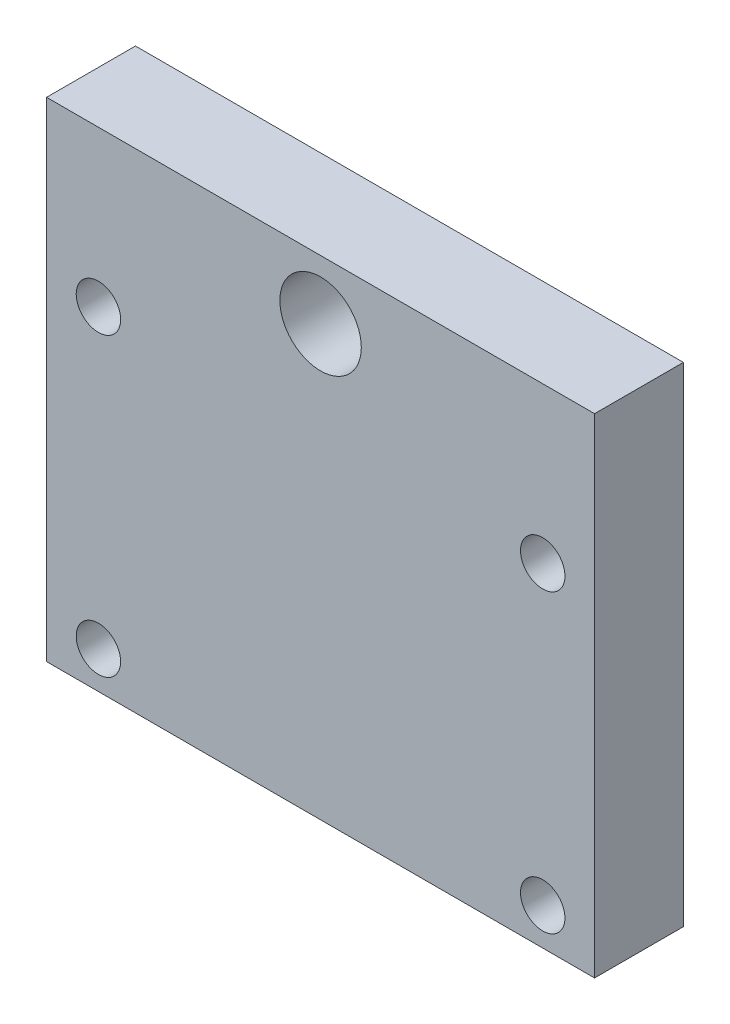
ISO-10303-21;
HEADER;
FILE_DESCRIPTION(('STEP AP214'),'2;1');
FILE_NAME('part.step','',(''),(''),'','','');
FILE_SCHEMA(('AUTOMOTIVE_DESIGN { 1 0 10303 214 1 1 1 1 }'));
ENDSEC;
DATA;
#1=APPLICATION_CONTEXT('core data for automotive mechanical design processes');
#2=APPLICATION_PROTOCOL_DEFINITION('international standard','automotive_design',2000,#1);
#3=PRODUCT_CONTEXT('',#1,'mechanical');
#4=PRODUCT('Part','Part','',(#3));
#5=PRODUCT_RELATED_PRODUCT_CATEGORY('part','',(#4));
#6=PRODUCT_DEFINITION_FORMATION('','',#4);
#7=PRODUCT_DEFINITION_CONTEXT('part definition',#1,'design');
#8=PRODUCT_DEFINITION('design','',#6,#7);
#9=PRODUCT_DEFINITION_SHAPE('','',#8);
#10=(LENGTH_UNIT() NAMED_UNIT(*) SI_UNIT(.MILLI.,.METRE.));
#11=(NAMED_UNIT(*) PLANE_ANGLE_UNIT() SI_UNIT($,.RADIAN.));
#12=(NAMED_UNIT(*) SI_UNIT($,.STERADIAN.) SOLID_ANGLE_UNIT());
#13=UNCERTAINTY_MEASURE_WITH_UNIT(LENGTH_MEASURE(1.E-05),#10,'distance_accuracy_value','');
#14=(GEOMETRIC_REPRESENTATION_CONTEXT(3) GLOBAL_UNCERTAINTY_ASSIGNED_CONTEXT((#13)) GLOBAL_UNIT_ASSIGNED_CONTEXT((#10,
#11,#12)) REPRESENTATION_CONTEXT('',''));
#15=CARTESIAN_POINT('',(0.,0.,0.));
#16=DIRECTION('',(0.,0.,1.));
#17=DIRECTION('',(1.,0.,0.));
#18=AXIS2_PLACEMENT_3D('',#15,#16,#17);
#19=CARTESIAN_POINT('',(0.,0.,6.));
#20=DIRECTION('',(0.,0.,-1.));
#21=DIRECTION('',(-1.,0.,0.));
#22=AXIS2_PLACEMENT_3D('',#19,#20,#21);
#23=PLANE('',#22);
#24=CARTESIAN_POINT('',(18.5,29.,6.));
#25=DIRECTION('',(0.,0.,1.));
#26=DIRECTION('',(1.,0.,0.));
#27=AXIS2_PLACEMENT_3D('',#24,#25,#26);
#28=CIRCLE('',#27,2.75);
#29=CARTESIAN_POINT('',(21.25,29.,6.));
#30=VERTEX_POINT('',#29);
#31=EDGE_CURVE('E89',#30,#30,#28,.T.);
#32=ORIENTED_EDGE('',*,*,#31,.F.);
#33=EDGE_LOOP('',(#32));
#34=FACE_BOUND('',#33,.T.);
#35=CARTESIAN_POINT('',(33.5,22.5,6.));
#36=DIRECTION('',(0.,0.,1.));
#37=DIRECTION('',(1.,0.,0.));
#38=AXIS2_PLACEMENT_3D('',#35,#36,#37);
#39=CIRCLE('',#38,1.5);
#40=CARTESIAN_POINT('',(35.,22.5,6.));
#41=VERTEX_POINT('',#40);
#42=EDGE_CURVE('E104',#41,#41,#39,.T.);
#43=ORIENTED_EDGE('',*,*,#42,.F.);
#44=EDGE_LOOP('',(#43));
#45=FACE_BOUND('',#44,.T.);
#46=CARTESIAN_POINT('',(3.5,2.5,6.));
#47=DIRECTION('',(0.,0.,1.));
#48=DIRECTION('',(1.,0.,0.));
#49=AXIS2_PLACEMENT_3D('',#46,#47,#48);
#50=CIRCLE('',#49,1.5);
#51=CARTESIAN_POINT('',(5.,2.5,6.));
#52=VERTEX_POINT('',#51);
#53=EDGE_CURVE('E116',#52,#52,#50,.T.);
#54=ORIENTED_EDGE('',*,*,#53,.F.);
#55=EDGE_LOOP('',(#54));
#56=FACE_BOUND('',#55,.T.);
#57=DIRECTION('',(0.,-1.,0.));
#58=VECTOR('',#57,1.);
#59=CARTESIAN_POINT('',(0.,0.,6.));
#60=LINE('',#59,#58);
#61=CARTESIAN_POINT('',(0.,33.,6.));
#62=VERTEX_POINT('',#61);
#63=CARTESIAN_POINT('',(0.,0.,6.));
#64=VERTEX_POINT('',#63);
#65=EDGE_CURVE('E65',#62,#64,#60,.T.);
#66=ORIENTED_EDGE('',*,*,#65,.T.);
#67=DIRECTION('',(1.,0.,0.));
#68=VECTOR('',#67,1.);
#69=CARTESIAN_POINT('',(0.,0.,6.));
#70=LINE('',#69,#68);
#71=CARTESIAN_POINT('',(37.,0.,6.));
#72=VERTEX_POINT('',#71);
#73=EDGE_CURVE('E42',#64,#72,#70,.T.);
#74=ORIENTED_EDGE('',*,*,#73,.T.);
#75=DIRECTION('',(0.,1.,0.));
#76=VECTOR('',#75,1.);
#77=CARTESIAN_POINT('',(37.,0.,6.));
#78=LINE('',#77,#76);
#79=CARTESIAN_POINT('',(37.,33.,6.));
#80=VERTEX_POINT('',#79);
#81=EDGE_CURVE('E76',#72,#80,#78,.T.);
#82=ORIENTED_EDGE('',*,*,#81,.T.);
#83=DIRECTION('',(1.,0.,0.));
#84=VECTOR('',#83,1.);
#85=CARTESIAN_POINT('',(0.,33.,6.));
#86=LINE('',#85,#84);
#87=EDGE_CURVE('E73',#62,#80,#86,.T.);
#88=ORIENTED_EDGE('',*,*,#87,.F.);
#89=EDGE_LOOP('',(#66,#74,#82,#88));
#90=FACE_BOUND('',#89,.T.);
#91=CARTESIAN_POINT('',(33.5,2.50000000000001,6.));
#92=DIRECTION('',(0.,0.,1.));
#93=DIRECTION('',(-1.,0.,0.));
#94=AXIS2_PLACEMENT_3D('',#91,#92,#93);
#95=CIRCLE('',#94,1.5);
#96=CARTESIAN_POINT('',(32.,2.50000000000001,6.));
#97=VERTEX_POINT('',#96);
#98=EDGE_CURVE('E110',#97,#97,#95,.T.);
#99=ORIENTED_EDGE('',*,*,#98,.F.);
#100=EDGE_LOOP('',(#99));
#101=FACE_BOUND('',#100,.T.);
#102=CARTESIAN_POINT('',(3.5,22.5,6.));
#103=DIRECTION('',(0.,0.,1.));
#104=DIRECTION('',(-1.,0.,0.));
#105=AXIS2_PLACEMENT_3D('',#102,#103,#104);
#106=CIRCLE('',#105,1.5);
#107=CARTESIAN_POINT('',(2.,22.5,6.));
#108=VERTEX_POINT('',#107);
#109=EDGE_CURVE('E98',#108,#108,#106,.T.);
#110=ORIENTED_EDGE('',*,*,#109,.F.);
#111=EDGE_LOOP('',(#110));
#112=FACE_BOUND('',#111,.T.);
#113=ADVANCED_FACE('F27',(#34,#45,#56,#90,#101,#112),#23,.F.);
#114=CARTESIAN_POINT('',(0.,0.,0.));
#115=DIRECTION('',(0.,0.,-1.));
#116=DIRECTION('',(-1.,0.,0.));
#117=AXIS2_PLACEMENT_3D('',#114,#115,#116);
#118=PLANE('',#117);
#119=CARTESIAN_POINT('',(18.5,29.,0.));
#120=DIRECTION('',(0.,0.,1.));
#121=DIRECTION('',(1.,0.,0.));
#122=AXIS2_PLACEMENT_3D('',#119,#120,#121);
#123=CIRCLE('',#122,2.75);
#124=CARTESIAN_POINT('',(21.25,29.,0.));
#125=VERTEX_POINT('',#124);
#126=EDGE_CURVE('E86',#125,#125,#123,.T.);
#127=ORIENTED_EDGE('',*,*,#126,.T.);
#128=EDGE_LOOP('',(#127));
#129=FACE_BOUND('',#128,.T.);
#130=CARTESIAN_POINT('',(33.5,22.5,0.));
#131=DIRECTION('',(0.,0.,1.));
#132=DIRECTION('',(1.,0.,0.));
#133=AXIS2_PLACEMENT_3D('',#130,#131,#132);
#134=CIRCLE('',#133,1.5);
#135=CARTESIAN_POINT('',(35.,22.5,0.));
#136=VERTEX_POINT('',#135);
#137=EDGE_CURVE('E101',#136,#136,#134,.T.);
#138=ORIENTED_EDGE('',*,*,#137,.T.);
#139=EDGE_LOOP('',(#138));
#140=FACE_BOUND('',#139,.T.);
#141=CARTESIAN_POINT('',(3.5,2.5,0.));
#142=DIRECTION('',(0.,0.,1.));
#143=DIRECTION('',(1.,0.,0.));
#144=AXIS2_PLACEMENT_3D('',#141,#142,#143);
#145=CIRCLE('',#144,1.5);
#146=CARTESIAN_POINT('',(5.,2.5,0.));
#147=VERTEX_POINT('',#146);
#148=EDGE_CURVE('E113',#147,#147,#145,.T.);
#149=ORIENTED_EDGE('',*,*,#148,.T.);
#150=EDGE_LOOP('',(#149));
#151=FACE_BOUND('',#150,.T.);
#152=DIRECTION('',(0.,-1.,0.));
#153=VECTOR('',#152,1.);
#154=CARTESIAN_POINT('',(0.,0.,0.));
#155=LINE('',#154,#153);
#156=CARTESIAN_POINT('',(0.,33.,0.));
#157=VERTEX_POINT('',#156);
#158=CARTESIAN_POINT('',(0.,0.,0.));
#159=VERTEX_POINT('',#158);
#160=EDGE_CURVE('E119',#157,#159,#155,.T.);
#161=ORIENTED_EDGE('',*,*,#160,.F.);
#162=DIRECTION('',(-1.,0.,0.));
#163=VECTOR('',#162,1.);
#164=CARTESIAN_POINT('',(0.,33.,0.));
#165=LINE('',#164,#163);
#166=CARTESIAN_POINT('',(37.,33.,0.));
#167=VERTEX_POINT('',#166);
#168=EDGE_CURVE('E85',#167,#157,#165,.T.);
#169=ORIENTED_EDGE('',*,*,#168,.F.);
#170=DIRECTION('',(0.,1.,0.));
#171=VECTOR('',#170,1.);
#172=CARTESIAN_POINT('',(37.,0.,0.));
#173=LINE('',#172,#171);
#174=CARTESIAN_POINT('',(37.,0.,0.));
#175=VERTEX_POINT('',#174);
#176=EDGE_CURVE('E70',#175,#167,#173,.T.);
#177=ORIENTED_EDGE('',*,*,#176,.F.);
#178=DIRECTION('',(1.,0.,0.));
#179=VECTOR('',#178,1.);
#180=CARTESIAN_POINT('',(0.,0.,0.));
#181=LINE('',#180,#179);
#182=EDGE_CURVE('E121',#159,#175,#181,.T.);
#183=ORIENTED_EDGE('',*,*,#182,.F.);
#184=EDGE_LOOP('',(#161,#169,#177,#183));
#185=FACE_BOUND('',#184,.T.);
#186=CARTESIAN_POINT('',(33.5,2.50000000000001,0.));
#187=DIRECTION('',(0.,0.,1.));
#188=DIRECTION('',(-1.,0.,0.));
#189=AXIS2_PLACEMENT_3D('',#186,#187,#188);
#190=CIRCLE('',#189,1.5);
#191=CARTESIAN_POINT('',(32.,2.50000000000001,0.));
#192=VERTEX_POINT('',#191);
#193=EDGE_CURVE('E107',#192,#192,#190,.T.);
#194=ORIENTED_EDGE('',*,*,#193,.T.);
#195=EDGE_LOOP('',(#194));
#196=FACE_BOUND('',#195,.T.);
#197=CARTESIAN_POINT('',(3.5,22.5,0.));
#198=DIRECTION('',(0.,0.,1.));
#199=DIRECTION('',(-1.,0.,0.));
#200=AXIS2_PLACEMENT_3D('',#197,#198,#199);
#201=CIRCLE('',#200,1.5);
#202=CARTESIAN_POINT('',(2.,22.5,0.));
#203=VERTEX_POINT('',#202);
#204=EDGE_CURVE('E95',#203,#203,#201,.T.);
#205=ORIENTED_EDGE('',*,*,#204,.T.);
#206=EDGE_LOOP('',(#205));
#207=FACE_BOUND('',#206,.T.);
#208=ADVANCED_FACE('F130',(#129,#140,#151,#185,#196,#207),#118,.T.);
#209=CARTESIAN_POINT('',(0.,0.,6.));
#210=DIRECTION('',(1.,0.,0.));
#211=DIRECTION('',(0.,0.,-1.));
#212=AXIS2_PLACEMENT_3D('',#209,#210,#211);
#213=PLANE('',#212);
#214=ORIENTED_EDGE('',*,*,#160,.T.);
#215=DIRECTION('',(0.,0.,-1.));
#216=VECTOR('',#215,1.);
#217=CARTESIAN_POINT('',(0.,0.,6.));
#218=LINE('',#217,#216);
#219=EDGE_CURVE('E11',#64,#159,#218,.T.);
#220=ORIENTED_EDGE('',*,*,#219,.F.);
#221=ORIENTED_EDGE('',*,*,#65,.F.);
#222=DIRECTION('',(0.,0.,1.));
#223=VECTOR('',#222,1.);
#224=CARTESIAN_POINT('',(0.,33.,0.));
#225=LINE('',#224,#223);
#226=EDGE_CURVE('E69',#157,#62,#225,.T.);
#227=ORIENTED_EDGE('',*,*,#226,.F.);
#228=EDGE_LOOP('',(#214,#220,#221,#227));
#229=FACE_BOUND('',#228,.T.);
#230=ADVANCED_FACE('F29',(#229),#213,.F.);
#231=CARTESIAN_POINT('',(0.,0.,6.));
#232=DIRECTION('',(0.,1.,0.));
#233=DIRECTION('',(-1.,0.,0.));
#234=AXIS2_PLACEMENT_3D('',#231,#232,#233);
#235=PLANE('',#234);
#236=ORIENTED_EDGE('',*,*,#182,.T.);
#237=DIRECTION('',(0.,0.,-1.));
#238=VECTOR('',#237,1.);
#239=CARTESIAN_POINT('',(37.,0.,6.));
#240=LINE('',#239,#238);
#241=EDGE_CURVE('E35',#72,#175,#240,.T.);
#242=ORIENTED_EDGE('',*,*,#241,.F.);
#243=ORIENTED_EDGE('',*,*,#73,.F.);
#244=ORIENTED_EDGE('',*,*,#219,.T.);
#245=EDGE_LOOP('',(#236,#242,#243,#244));
#246=FACE_BOUND('',#245,.T.);
#247=ADVANCED_FACE('F132',(#246),#235,.F.);
#248=CARTESIAN_POINT('',(37.,0.,6.));
#249=DIRECTION('',(-1.,0.,0.));
#250=DIRECTION('',(0.,0.,1.));
#251=AXIS2_PLACEMENT_3D('',#248,#249,#250);
#252=PLANE('',#251);
#253=ORIENTED_EDGE('',*,*,#176,.T.);
#254=DIRECTION('',(0.,0.,-1.));
#255=VECTOR('',#254,1.);
#256=CARTESIAN_POINT('',(37.,33.,0.));
#257=LINE('',#256,#255);
#258=EDGE_CURVE('E80',#80,#167,#257,.T.);
#259=ORIENTED_EDGE('',*,*,#258,.F.);
#260=ORIENTED_EDGE('',*,*,#81,.F.);
#261=ORIENTED_EDGE('',*,*,#241,.T.);
#262=EDGE_LOOP('',(#253,#259,#260,#261));
#263=FACE_BOUND('',#262,.T.);
#264=ADVANCED_FACE('F128',(#263),#252,.F.);
#265=CARTESIAN_POINT('',(3.5,2.5,6.));
#266=DIRECTION('',(0.,0.,-1.));
#267=DIRECTION('',(-1.,0.,0.));
#268=AXIS2_PLACEMENT_3D('',#265,#266,#267);
#269=CYLINDRICAL_SURFACE('',#268,1.5);
#270=ORIENTED_EDGE('',*,*,#53,.T.);
#271=EDGE_LOOP('',(#270));
#272=FACE_BOUND('',#271,.T.);
#273=ORIENTED_EDGE('',*,*,#148,.F.);
#274=EDGE_LOOP('',(#273));
#275=FACE_BOUND('',#274,.T.);
#276=ADVANCED_FACE('F138',(#272,#275),#269,.F.);
#277=CARTESIAN_POINT('',(33.5,2.50000000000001,6.));
#278=DIRECTION('',(0.,0.,-1.));
#279=DIRECTION('',(-1.,0.,0.));
#280=AXIS2_PLACEMENT_3D('',#277,#278,#279);
#281=CYLINDRICAL_SURFACE('',#280,1.5);
#282=ORIENTED_EDGE('',*,*,#98,.T.);
#283=EDGE_LOOP('',(#282));
#284=FACE_BOUND('',#283,.T.);
#285=ORIENTED_EDGE('',*,*,#193,.F.);
#286=EDGE_LOOP('',(#285));
#287=FACE_BOUND('',#286,.T.);
#288=ADVANCED_FACE('F154',(#284,#287),#281,.F.);
#289=CARTESIAN_POINT('',(33.5,22.5,6.));
#290=DIRECTION('',(0.,0.,-1.));
#291=DIRECTION('',(-1.,0.,0.));
#292=AXIS2_PLACEMENT_3D('',#289,#290,#291);
#293=CYLINDRICAL_SURFACE('',#292,1.5);
#294=ORIENTED_EDGE('',*,*,#42,.T.);
#295=EDGE_LOOP('',(#294));
#296=FACE_BOUND('',#295,.T.);
#297=ORIENTED_EDGE('',*,*,#137,.F.);
#298=EDGE_LOOP('',(#297));
#299=FACE_BOUND('',#298,.T.);
#300=ADVANCED_FACE('F158',(#296,#299),#293,.F.);
#301=CARTESIAN_POINT('',(3.5,22.5,6.));
#302=DIRECTION('',(0.,0.,-1.));
#303=DIRECTION('',(-1.,0.,0.));
#304=AXIS2_PLACEMENT_3D('',#301,#302,#303);
#305=CYLINDRICAL_SURFACE('',#304,1.5);
#306=ORIENTED_EDGE('',*,*,#109,.T.);
#307=EDGE_LOOP('',(#306));
#308=FACE_BOUND('',#307,.T.);
#309=ORIENTED_EDGE('',*,*,#204,.F.);
#310=EDGE_LOOP('',(#309));
#311=FACE_BOUND('',#310,.T.);
#312=ADVANCED_FACE('F162',(#308,#311),#305,.F.);
#313=CARTESIAN_POINT('',(0.,33.,6.));
#314=DIRECTION('',(0.,1.,0.));
#315=DIRECTION('',(0.,0.,1.));
#316=AXIS2_PLACEMENT_3D('',#313,#314,#315);
#317=PLANE('',#316);
#318=ORIENTED_EDGE('',*,*,#226,.T.);
#319=ORIENTED_EDGE('',*,*,#87,.T.);
#320=ORIENTED_EDGE('',*,*,#258,.T.);
#321=ORIENTED_EDGE('',*,*,#168,.T.);
#322=EDGE_LOOP('',(#318,#319,#320,#321));
#323=FACE_BOUND('',#322,.T.);
#324=ADVANCED_FACE('F83',(#323),#317,.T.);
#325=CARTESIAN_POINT('',(18.5,29.,0.));
#326=DIRECTION('',(0.,0.,1.));
#327=DIRECTION('',(1.,0.,0.));
#328=AXIS2_PLACEMENT_3D('',#325,#326,#327);
#329=CYLINDRICAL_SURFACE('',#328,2.75);
#330=ORIENTED_EDGE('',*,*,#126,.F.);
#331=EDGE_LOOP('',(#330));
#332=FACE_BOUND('',#331,.T.);
#333=ORIENTED_EDGE('',*,*,#31,.T.);
#334=EDGE_LOOP('',(#333));
#335=FACE_BOUND('',#334,.T.);
#336=ADVANCED_FACE('F168',(#332,#335),#329,.F.);
#337=CLOSED_SHELL('',(#113,#208,#230,#247,#264,#276,#288,#300,#312,#324,#336));
#338=MANIFOLD_SOLID_BREP('B2',#337);
#339=ADVANCED_BREP_SHAPE_REPRESENTATION('',(#18,#338),#14);
#340=SHAPE_DEFINITION_REPRESENTATION(#9,#339);
ENDSEC;
END-ISO-10303-21;
